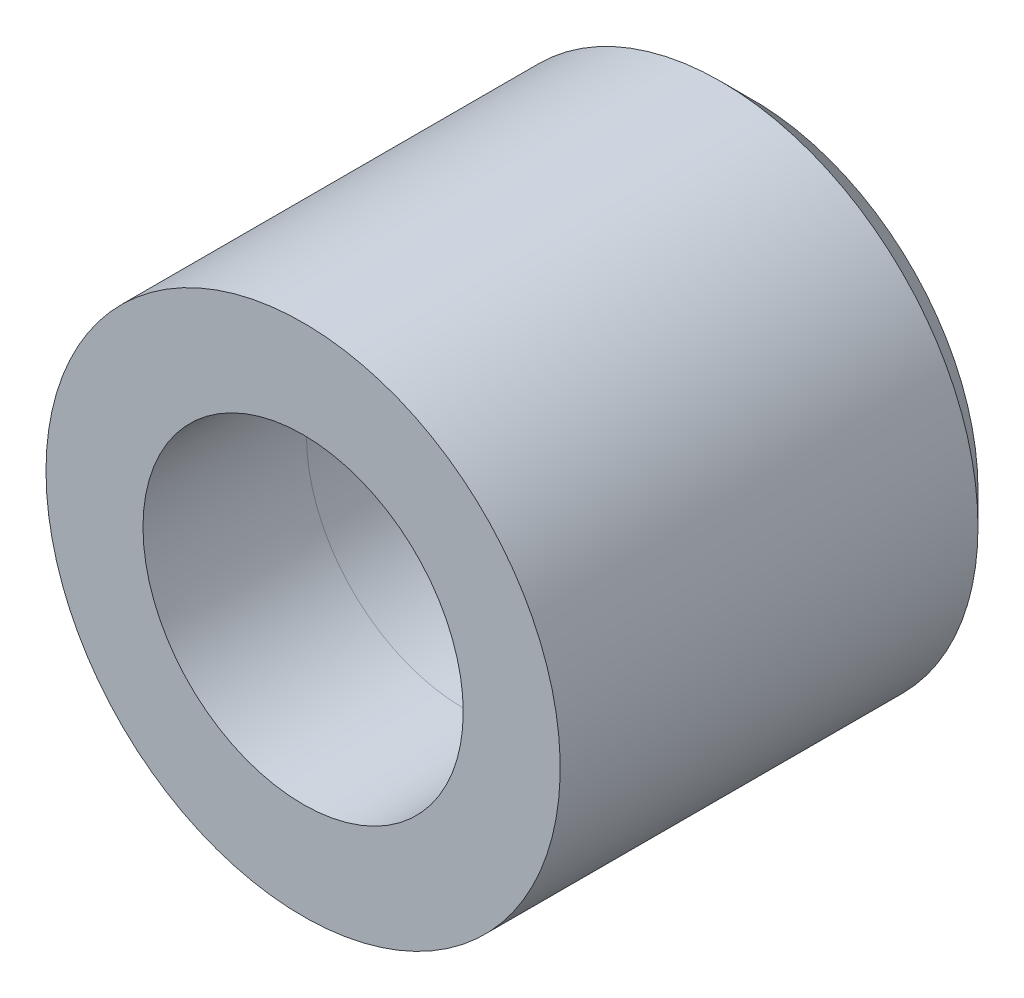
ISO-10303-21;
HEADER;
FILE_DESCRIPTION(('STEP AP214'),'2;1');
FILE_NAME('part.step','',(''),(''),'','','');
FILE_SCHEMA(('AUTOMOTIVE_DESIGN { 1 0 10303 214 1 1 1 1 }'));
ENDSEC;
DATA;
#1=APPLICATION_CONTEXT('core data for automotive mechanical design processes');
#2=APPLICATION_PROTOCOL_DEFINITION('international standard','automotive_design',2000,#1);
#3=PRODUCT_CONTEXT('',#1,'mechanical');
#4=PRODUCT('Part','Part','',(#3));
#5=PRODUCT_RELATED_PRODUCT_CATEGORY('part','',(#4));
#6=PRODUCT_DEFINITION_FORMATION('','',#4);
#7=PRODUCT_DEFINITION_CONTEXT('part definition',#1,'design');
#8=PRODUCT_DEFINITION('design','',#6,#7);
#9=PRODUCT_DEFINITION_SHAPE('','',#8);
#10=(LENGTH_UNIT() NAMED_UNIT(*) SI_UNIT(.MILLI.,.METRE.));
#11=(NAMED_UNIT(*) PLANE_ANGLE_UNIT() SI_UNIT($,.RADIAN.));
#12=(NAMED_UNIT(*) SI_UNIT($,.STERADIAN.) SOLID_ANGLE_UNIT());
#13=UNCERTAINTY_MEASURE_WITH_UNIT(LENGTH_MEASURE(1.E-05),#10,'distance_accuracy_value','');
#14=(GEOMETRIC_REPRESENTATION_CONTEXT(3) GLOBAL_UNCERTAINTY_ASSIGNED_CONTEXT((#13)) GLOBAL_UNIT_ASSIGNED_CONTEXT((#10,
#11,#12)) REPRESENTATION_CONTEXT('',''));
#15=CARTESIAN_POINT('',(0.,0.,0.));
#16=DIRECTION('',(0.,0.,1.));
#17=DIRECTION('',(1.,0.,0.));
#18=AXIS2_PLACEMENT_3D('',#15,#16,#17);
#19=CARTESIAN_POINT('',(0.,0.,-5.97231293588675));
#20=DIRECTION('',(0.,0.,1.));
#21=DIRECTION('',(1.,0.,0.));
#22=AXIS2_PLACEMENT_3D('',#19,#20,#21);
#23=CONICAL_SURFACE('',#22,6.92295667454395,0.785398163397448);
#24=CARTESIAN_POINT('',(0.,0.,-9.));
#25=DIRECTION('',(0.,0.,1.));
#26=DIRECTION('',(-1.,0.,0.));
#27=AXIS2_PLACEMENT_3D('',#24,#25,#26);
#28=CIRCLE('',#27,3.89526961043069);
#29=CARTESIAN_POINT('',(3.89526961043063,0.,-9.));
#30=VERTEX_POINT('',#29);
#31=CARTESIAN_POINT('',(-3.89526961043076,0.,-9.));
#32=VERTEX_POINT('',#31);
#33=EDGE_CURVE('E143',#30,#32,#28,.T.);
#34=ORIENTED_EDGE('',*,*,#33,.F.);
#35=CARTESIAN_POINT('',(3.89526937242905,0.,-9.00000023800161));
#36=CARTESIAN_POINT('',(4.89526929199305,0.,-8.00000031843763));
#37=B_SPLINE_CURVE_WITH_KNOTS('',1,(#35,#36),.UNSPECIFIED.,.F.,.F.,(2,2),(0.562659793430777,
0.707106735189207),.UNSPECIFIED.);
#38=CARTESIAN_POINT('',(4.89526961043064,0.,-8.));
#39=VERTEX_POINT('',#38);
#40=EDGE_CURVE('E44',#30,#39,#37,.T.);
#41=ORIENTED_EDGE('',*,*,#40,.T.);
#42=CARTESIAN_POINT('',(0.,0.,-8.));
#43=DIRECTION('',(0.,0.,-1.));
#44=DIRECTION('',(-1.,0.,0.));
#45=AXIS2_PLACEMENT_3D('',#42,#43,#44);
#46=CIRCLE('',#45,4.8952696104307);
#47=CARTESIAN_POINT('',(-4.89526961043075,0.,-8.));
#48=VERTEX_POINT('',#47);
#49=EDGE_CURVE('E11',#48,#39,#46,.T.);
#50=ORIENTED_EDGE('',*,*,#49,.F.);
#51=CARTESIAN_POINT('',(0.,0.,-8.));
#52=DIRECTION('',(0.,0.,-1.));
#53=DIRECTION('',(-1.,0.,0.));
#54=AXIS2_PLACEMENT_3D('',#51,#52,#53);
#55=CIRCLE('',#54,4.8952696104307);
#56=EDGE_CURVE('E51',#39,#48,#55,.T.);
#57=ORIENTED_EDGE('',*,*,#56,.F.);
#58=ORIENTED_EDGE('',*,*,#40,.F.);
#59=CARTESIAN_POINT('',(0.,0.,-9.));
#60=DIRECTION('',(0.,0.,1.));
#61=DIRECTION('',(-1.,0.,0.));
#62=AXIS2_PLACEMENT_3D('',#59,#60,#61);
#63=CIRCLE('',#62,3.89526961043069);
#64=EDGE_CURVE('E59',#32,#30,#63,.T.);
#65=ORIENTED_EDGE('',*,*,#64,.F.);
#66=EDGE_LOOP('',(#34,#41,#50,#57,#58,#65));
#67=FACE_BOUND('',#66,.T.);
#68=ADVANCED_FACE('F36',(#67),#23,.F.);
#69=CARTESIAN_POINT('',(0.,0.,-7.5));
#70=DIRECTION('',(0.,0.,-1.));
#71=DIRECTION('',(-1.,0.,0.));
#72=AXIS2_PLACEMENT_3D('',#69,#70,#71);
#73=CYLINDRICAL_SURFACE('',#72,4.8952696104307);
#74=CARTESIAN_POINT('',(0.,0.,-6.));
#75=DIRECTION('',(0.,0.,-1.));
#76=DIRECTION('',(-1.,0.,0.));
#77=AXIS2_PLACEMENT_3D('',#74,#75,#76);
#78=CIRCLE('',#77,4.8952696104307);
#79=CARTESIAN_POINT('',(-4.89526961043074,0.,-6.));
#80=VERTEX_POINT('',#79);
#81=EDGE_CURVE('E152',#80,#80,#78,.T.);
#82=ORIENTED_EDGE('',*,*,#81,.F.);
#83=CARTESIAN_POINT('',(-4.89526961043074,0.,-5.99999694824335));
#84=CARTESIAN_POINT('',(-4.89526961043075,0.,-8.00000201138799));
#85=B_SPLINE_CURVE_WITH_KNOTS('',1,(#83,#84),.UNSPECIFIED.,.F.,.F.,(2,2),(0.0833320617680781,
0.91666750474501),.UNSPECIFIED.);
#86=EDGE_CURVE('E147',#80,#48,#85,.T.);
#87=ORIENTED_EDGE('',*,*,#86,.T.);
#88=ORIENTED_EDGE('',*,*,#49,.T.);
#89=ORIENTED_EDGE('',*,*,#56,.T.);
#90=ORIENTED_EDGE('',*,*,#86,.F.);
#91=EDGE_LOOP('',(#82,#87,#88,#89,#90));
#92=FACE_BOUND('',#91,.T.);
#93=ADVANCED_FACE('F191',(#92),#73,.F.);
#94=CARTESIAN_POINT('',(8.95912010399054,-8.09616584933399,-9.));
#95=DIRECTION('',(0.,0.,-1.));
#96=DIRECTION('',(-1.,0.,0.));
#97=AXIS2_PLACEMENT_3D('',#94,#95,#96);
#98=PLANE('',#97);
#99=CARTESIAN_POINT('',(-1.04744440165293E-13,0.,-8.99999999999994));
#100=DIRECTION('',(0.,0.,-1.));
#101=DIRECTION('',(-1.,0.,0.));
#102=AXIS2_PLACEMENT_3D('',#99,#100,#101);
#103=CIRCLE('',#102,2.09999999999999);
#104=CARTESIAN_POINT('',(-2.1000000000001,0.,-8.99999999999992));
#105=VERTEX_POINT('',#104);
#106=EDGE_CURVE('E103',#105,#105,#103,.T.);
#107=ORIENTED_EDGE('',*,*,#106,.T.);
#108=EDGE_LOOP('',(#107));
#109=FACE_BOUND('',#108,.T.);
#110=ORIENTED_EDGE('',*,*,#64,.T.);
#111=ORIENTED_EDGE('',*,*,#33,.T.);
#112=EDGE_LOOP('',(#110,#111));
#113=FACE_BOUND('',#112,.T.);
#114=ADVANCED_FACE('F193',(#109,#113),#98,.F.);
#115=CARTESIAN_POINT('',(0.,0.,-1.));
#116=DIRECTION('',(0.,0.,1.));
#117=DIRECTION('',(-1.,0.,0.));
#118=AXIS2_PLACEMENT_3D('',#115,#116,#117);
#119=CONICAL_SURFACE('',#118,4.98254493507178,0.0174532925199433);
#120=ORIENTED_EDGE('',*,*,#81,.T.);
#121=CARTESIAN_POINT('',(-4.89526961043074,0.,-6.));
#122=CARTESIAN_POINT('',(-4.98254493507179,0.,-0.999999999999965));
#123=B_SPLINE_CURVE_WITH_KNOTS('',1,(#121,#122),.UNSPECIFIED.,.F.,.F.,(2,2),(0.,1.),.UNSPECIFIED.);
#124=CARTESIAN_POINT('',(-4.98254493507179,0.,-0.999999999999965));
#125=VERTEX_POINT('',#124);
#126=EDGE_CURVE('E108',#80,#125,#123,.T.);
#127=ORIENTED_EDGE('',*,*,#126,.T.);
#128=CARTESIAN_POINT('',(0.,0.,-1.));
#129=DIRECTION('',(0.,0.,-1.));
#130=DIRECTION('',(1.,0.,0.));
#131=AXIS2_PLACEMENT_3D('',#128,#129,#130);
#132=CIRCLE('',#131,4.98254493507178);
#133=CARTESIAN_POINT('',(4.98254493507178,0.,-1.00000000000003));
#134=VERTEX_POINT('',#133);
#135=EDGE_CURVE('E133',#134,#125,#132,.T.);
#136=ORIENTED_EDGE('',*,*,#135,.F.);
#137=CARTESIAN_POINT('',(0.,0.,-1.));
#138=DIRECTION('',(0.,0.,-1.));
#139=DIRECTION('',(1.,0.,0.));
#140=AXIS2_PLACEMENT_3D('',#137,#138,#139);
#141=CIRCLE('',#140,4.98254493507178);
#142=EDGE_CURVE('E126',#125,#134,#141,.T.);
#143=ORIENTED_EDGE('',*,*,#142,.F.);
#144=ORIENTED_EDGE('',*,*,#126,.F.);
#145=EDGE_LOOP('',(#120,#127,#136,#143,#144));
#146=FACE_BOUND('',#145,.T.);
#147=ADVANCED_FACE('F189',(#146),#119,.F.);
#148=CARTESIAN_POINT('',(0.,0.,-10.6862915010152));
#149=DIRECTION('',(0.,0.,1.));
#150=DIRECTION('',(1.,0.,0.));
#151=AXIS2_PLACEMENT_3D('',#148,#149,#150);
#152=CONICAL_SURFACE('',#151,11.3137084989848,0.785398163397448);
#153=CARTESIAN_POINT('',(-1.04744440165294E-13,0.,-15.));
#154=DIRECTION('',(0.,0.,1.));
#155=DIRECTION('',(-1.,0.,0.));
#156=AXIS2_PLACEMENT_3D('',#153,#154,#155);
#157=CIRCLE('',#156,7.);
#158=CARTESIAN_POINT('',(-7.00000000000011,0.,-15.));
#159=VERTEX_POINT('',#158);
#160=CARTESIAN_POINT('',(6.9999999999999,0.,-15.));
#161=VERTEX_POINT('',#160);
#162=EDGE_CURVE('E90',#159,#161,#157,.T.);
#163=ORIENTED_EDGE('',*,*,#162,.T.);
#164=CARTESIAN_POINT('',(7.00000107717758,0.,-14.9999989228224));
#165=CARTESIAN_POINT('',(7.9999983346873,0.,-14.0000016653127));
#166=B_SPLINE_CURVE_WITH_KNOTS('',1,(#164,#165),.UNSPECIFIED.,.F.,.F.,(2,2),(0.618718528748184,
0.707106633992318),.UNSPECIFIED.);
#167=CARTESIAN_POINT('',(7.9999999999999,0.,-14.));
#168=VERTEX_POINT('',#167);
#169=EDGE_CURVE('E95',#161,#168,#166,.T.);
#170=ORIENTED_EDGE('',*,*,#169,.T.);
#171=CARTESIAN_POINT('',(0.,0.,-14.));
#172=DIRECTION('',(0.,0.,-1.));
#173=DIRECTION('',(-1.,0.,0.));
#174=AXIS2_PLACEMENT_3D('',#171,#172,#173);
#175=CIRCLE('',#174,8.);
#176=CARTESIAN_POINT('',(-8.0000000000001,0.,-14.));
#177=VERTEX_POINT('',#176);
#178=EDGE_CURVE('E102',#168,#177,#175,.T.);
#179=ORIENTED_EDGE('',*,*,#178,.T.);
#180=CARTESIAN_POINT('',(0.,0.,-14.));
#181=DIRECTION('',(0.,0.,-1.));
#182=DIRECTION('',(-1.,0.,0.));
#183=AXIS2_PLACEMENT_3D('',#180,#181,#182);
#184=CIRCLE('',#183,8.);
#185=EDGE_CURVE('E105',#177,#168,#184,.T.);
#186=ORIENTED_EDGE('',*,*,#185,.T.);
#187=ORIENTED_EDGE('',*,*,#169,.F.);
#188=CARTESIAN_POINT('',(-1.04744440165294E-13,0.,-15.));
#189=DIRECTION('',(0.,0.,1.));
#190=DIRECTION('',(-1.,0.,0.));
#191=AXIS2_PLACEMENT_3D('',#188,#189,#190);
#192=CIRCLE('',#191,7.);
#193=EDGE_CURVE('E97',#161,#159,#192,.T.);
#194=ORIENTED_EDGE('',*,*,#193,.T.);
#195=EDGE_LOOP('',(#163,#170,#179,#186,#187,#194));
#196=FACE_BOUND('',#195,.T.);
#197=ADVANCED_FACE('F92',(#196),#152,.T.);
#198=CARTESIAN_POINT('',(0.,0.,-8.));
#199=DIRECTION('',(0.,0.,-1.));
#200=DIRECTION('',(-1.,0.,0.));
#201=AXIS2_PLACEMENT_3D('',#198,#199,#200);
#202=CYLINDRICAL_SURFACE('',#201,8.);
#203=CARTESIAN_POINT('',(0.,0.,-1.));
#204=DIRECTION('',(0.,0.,1.));
#205=DIRECTION('',(-1.,0.,0.));
#206=AXIS2_PLACEMENT_3D('',#203,#204,#205);
#207=CIRCLE('',#206,8.);
#208=CARTESIAN_POINT('',(-8.,0.,-0.999999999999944));
#209=VERTEX_POINT('',#208);
#210=EDGE_CURVE('E99',#209,#209,#207,.T.);
#211=ORIENTED_EDGE('',*,*,#210,.F.);
#212=CARTESIAN_POINT('',(-8.,0.,-1.00000099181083));
#213=CARTESIAN_POINT('',(-8.0000000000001,0.,-14.0000013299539));
#214=B_SPLINE_CURVE_WITH_KNOTS('',1,(#212,#213),.UNSPECIFIED.,.F.,.F.,(2,2),(0.0833333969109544,
0.916666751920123),.UNSPECIFIED.);
#215=EDGE_CURVE('E173',#209,#177,#214,.T.);
#216=ORIENTED_EDGE('',*,*,#215,.T.);
#217=ORIENTED_EDGE('',*,*,#178,.F.);
#218=ORIENTED_EDGE('',*,*,#185,.F.);
#219=ORIENTED_EDGE('',*,*,#215,.F.);
#220=EDGE_LOOP('',(#211,#216,#217,#218,#219));
#221=FACE_BOUND('',#220,.T.);
#222=ADVANCED_FACE('F217',(#221),#202,.T.);
#223=CARTESIAN_POINT('',(16.1,-14.5492267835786,-15.));
#224=DIRECTION('',(0.,0.,-1.));
#225=DIRECTION('',(-1.,0.,0.));
#226=AXIS2_PLACEMENT_3D('',#223,#224,#225);
#227=PLANE('',#226);
#228=CARTESIAN_POINT('',(-1.04744440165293E-13,0.,-14.9999999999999));
#229=DIRECTION('',(0.,0.,-1.));
#230=DIRECTION('',(-1.,0.,0.));
#231=AXIS2_PLACEMENT_3D('',#228,#229,#230);
#232=CIRCLE('',#231,2.09999999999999);
#233=CARTESIAN_POINT('',(-2.10000000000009,0.,-14.9999999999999));
#234=VERTEX_POINT('',#233);
#235=EDGE_CURVE('E258',#234,#234,#232,.T.);
#236=ORIENTED_EDGE('',*,*,#235,.F.);
#237=EDGE_LOOP('',(#236));
#238=FACE_BOUND('',#237,.T.);
#239=ORIENTED_EDGE('',*,*,#193,.F.);
#240=ORIENTED_EDGE('',*,*,#162,.F.);
#241=EDGE_LOOP('',(#239,#240));
#242=FACE_BOUND('',#241,.T.);
#243=ADVANCED_FACE('F101',(#238,#242),#227,.T.);
#244=CARTESIAN_POINT('',(-10.4,-16.6276877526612,-0.999999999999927));
#245=DIRECTION('',(0.,0.,1.));
#246=DIRECTION('',(1.,0.,0.));
#247=AXIS2_PLACEMENT_3D('',#244,#245,#246);
#248=PLANE('',#247);
#249=ORIENTED_EDGE('',*,*,#210,.T.);
#250=EDGE_LOOP('',(#249));
#251=FACE_BOUND('',#250,.T.);
#252=ORIENTED_EDGE('',*,*,#135,.T.);
#253=ORIENTED_EDGE('',*,*,#142,.T.);
#254=EDGE_LOOP('',(#252,#253));
#255=FACE_BOUND('',#254,.T.);
#256=ADVANCED_FACE('F230',(#251,#255),#248,.T.);
#257=CARTESIAN_POINT('',(-1.04744440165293E-13,0.,-14.9999999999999));
#258=DIRECTION('',(0.,0.,-1.));
#259=DIRECTION('',(-1.,0.,0.));
#260=AXIS2_PLACEMENT_3D('',#257,#258,#259);
#261=CYLINDRICAL_SURFACE('',#260,2.09999999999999);
#262=ORIENTED_EDGE('',*,*,#235,.T.);
#263=EDGE_LOOP('',(#262));
#264=FACE_BOUND('',#263,.T.);
#265=ORIENTED_EDGE('',*,*,#106,.F.);
#266=EDGE_LOOP('',(#265));
#267=FACE_BOUND('',#266,.T.);
#268=ADVANCED_FACE('F233',(#264,#267),#261,.F.);
#269=CLOSED_SHELL('',(#68,#93,#114,#147,#197,#222,#243,#256,#268));
#270=MANIFOLD_SOLID_BREP('B2',#269);
#271=ADVANCED_BREP_SHAPE_REPRESENTATION('',(#18,#270),#14);
#272=SHAPE_DEFINITION_REPRESENTATION(#9,#271);
ENDSEC;
END-ISO-10303-21;
